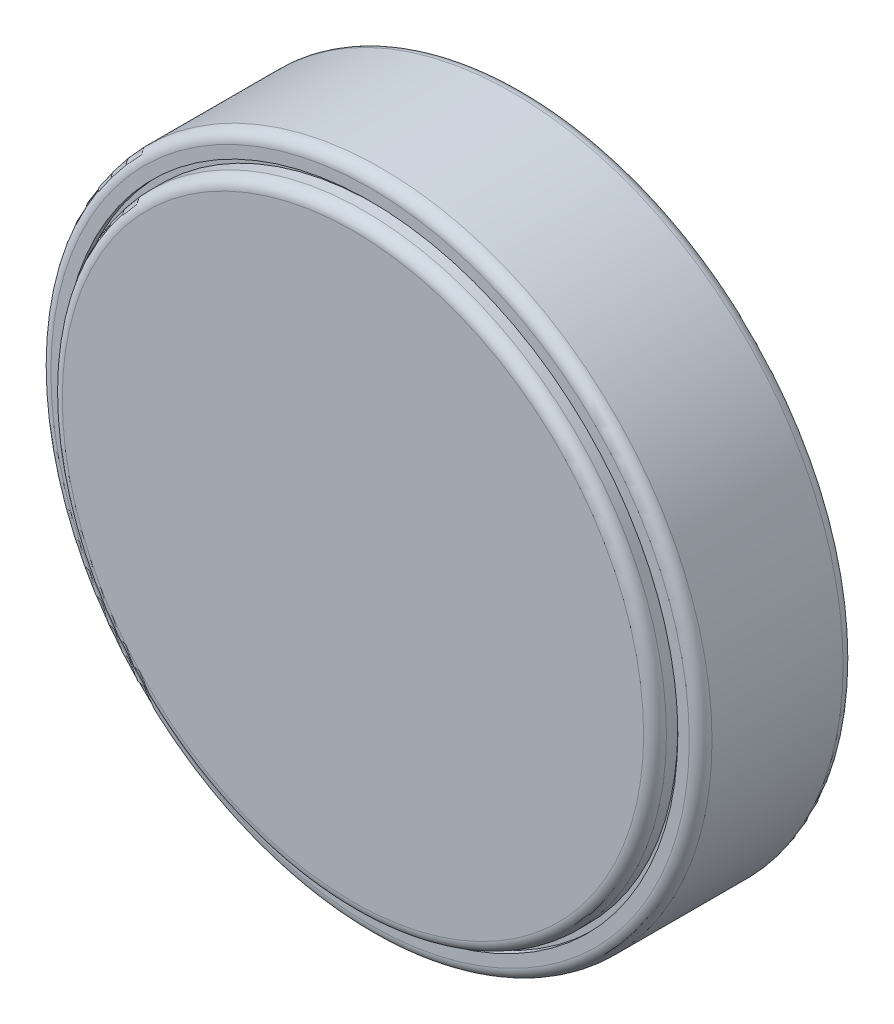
from build123d import *

# Parameters (mm, degrees)
ESQUISSE1_R        = 5.8
CORPS_DEPTH        = 2.7
ESQUISSE2_R        = 5.3
BOSS_EXTRU_1_DEPTH = 0.3
CONG_1_R           = 0.2
GORGE_START        = -0.1
ESQUISSE3_R        = 5.4
ESQUISSE3_R_2      = 5.3
GORGE_DEPTH        = 0.1


with BuildPart() as part:
    # Esquisse1 → corps (new body)
    with BuildSketch(Plane.XY):
        with Locations(Location((0, 0, 0), (0, 0, 180))):
            Circle(ESQUISSE1_R)
    extrude(amount=CORPS_DEPTH)

    # Esquisse2 → Boss.-Extru.1 (add)
    with BuildSketch(Plane.XY.offset(2.7)):
        Circle(ESQUISSE2_R)
    extrude(amount=BOSS_EXTRU_1_DEPTH)

    # Cong_1
    cong_1_edges = [part.edges().sort_by_distance(p)[0] for p in [
        (5.8, 0, 0),
        (5.8, 0, 2.7),
        (-5.3, 0, 3),
    ]]
    fillet(cong_1_edges, radius=CONG_1_R)

    # Esquisse3 → gorge (cut)
    with BuildSketch(Plane.XY.offset(2.7).offset(GORGE_START)):
        Circle(ESQUISSE3_R)
        Circle(ESQUISSE3_R_2, mode=Mode.SUBTRACT)
    extrude(amount=GORGE_DEPTH, mode=Mode.SUBTRACT)


solid = part.part
